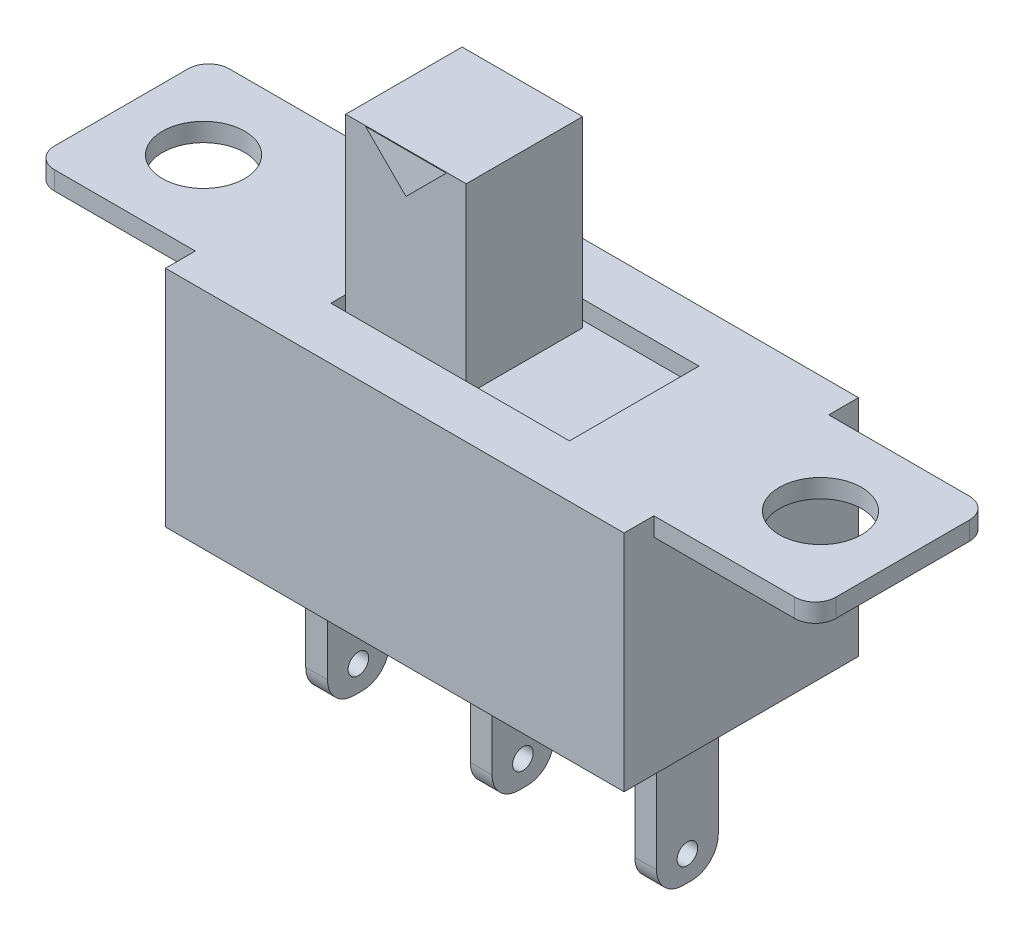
from build123d import *

# Parameters (mm, degrees)
ESQUISSE1_R             = 1
ESQUISSE1_W             = 5.8
ESQUISSE1_H             = 3.15
EXTRUSION1_DEPTH        = 0.45
ESQUISSE2_W             = 11.15
ESQUISSE2_H             = 5.7
EXTRUSION2_DEPTH        = 5
ESQUISSE3_W             = 0.53
ESQUISSE3_H             = 1.5
EXTRUSION3_DEPTH        = 4
CONG_1_R                = 0.65
ESQUISSE4_R             = 0.25
ENL_V_MAT_EXTRU_1_DEPTH = 18.585637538
ESQUISSE5_W             = 2.93
ESQUISSE5_H             = 2.83
EXTRUSION4_DEPTH        = 4.45
ENL_V_MAT_EXTRU_2_DEPTH = 21.697210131
CONG_2_R                = 0.5


with BuildPart() as part:
    # Esquisse1 → Extrusion1 (new body)
    with BuildSketch(Plane(origin=(0, 0, 0), x_dir=(1, 0, 0), z_dir=(0, 1, 0))):
        Polygon((14.218436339, 6.227312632), (14.218436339, 5.502312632), (18.143436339, 5.502312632), (18.143436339, 1.252312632), (14.218436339, 1.252312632), (14.218436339, 0.527312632), (3.068436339, 0.527312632), (3.068436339, 1.252312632), (-0.856563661, 1.252312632), (-0.856563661, 5.502312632), (3.068436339, 5.502312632), (3.068436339, 6.227312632), align=None)
        with Locations(Location((16.143436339, 3.377312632, 0), (0, 0, 270))):
            Circle(ESQUISSE1_R, mode=Mode.SUBTRACT)
        with Locations(Location((1.143436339, 3.377312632, 0), (0, 0, 90))):
            Circle(ESQUISSE1_R, mode=Mode.SUBTRACT)
        with Locations((8.715154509, 3.377312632)):
            Rectangle(ESQUISSE1_W, ESQUISSE1_H, mode=Mode.SUBTRACT)
    extrude(amount=EXTRUSION1_DEPTH)

    # Esquisse2 → Extrusion2 (add)
    with BuildSketch(Plane.XZ):
        with Locations((8.643436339, -3.377312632)):
            Rectangle(ESQUISSE2_W, ESQUISSE2_H)
    extrude(amount=EXTRUSION2_DEPTH)

    # Esquisse3 → Extrusion3 (add)
    with BuildSketch(Plane.XZ.offset(5)):
        with Locations((12.643436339, -3.377312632)):
            Rectangle(ESQUISSE3_W, ESQUISSE3_H)
        with Locations((8.643436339, -3.377312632)):
            Rectangle(ESQUISSE3_W, ESQUISSE3_H)
        with Locations((4.643436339, -3.377312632)):
            Rectangle(ESQUISSE3_W, ESQUISSE3_H)
    extrude(amount=EXTRUSION3_DEPTH)

    # Cong_1
    cong_1_edges = [part.edges().sort_by_distance(p)[0] for p in [
        (4.643436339, -9, -2.627312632),
        (4.643436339, -9, -4.127312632),
        (8.643436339, -9, -2.627312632),
        (8.643436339, -9, -4.127312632),
        (12.643436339, -9, -2.627312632),
        (12.643436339, -9, -4.127312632),
    ]]
    fillet(cong_1_edges, radius=CONG_1_R)

    # Esquisse4 → Enl_v. mat.-Extru.1 (cut, through all)
    with BuildSketch(Plane.ZY.offset(-4.378436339)):
        with Locations((-3.377312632, -8.382598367)):
            Circle(ESQUISSE4_R)
    extrude(amount=-ENL_V_MAT_EXTRU_1_DEPTH, mode=Mode.SUBTRACT)

    # Esquisse5 → Extrusion4 (add)
    with BuildSketch(Plane(origin=(0, 0, 0), x_dir=(-1, 0, 0), z_dir=(0, 1, 0))):
        with Locations((-7.480154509, -3.377312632)):
            Rectangle(ESQUISSE5_W, ESQUISSE5_H)
    extrude(amount=EXTRUSION4_DEPTH)

    # Esquisse6 → Enl_v. mat.-Extru.2 (cut, through all)
    with BuildSketch(Plane.XY.offset(-1.962312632)):
        Polygon((7.480154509, 3.45), (8.463104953, 4.432950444), (6.497204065, 4.432950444), align=None)
    extrude(amount=-ENL_V_MAT_EXTRU_2_DEPTH, mode=Mode.SUBTRACT)

    # Cong_2
    cong_2_edges = [part.edges().sort_by_distance(p)[0] for p in [
        (18.143436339, 0.225, -5.502312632),
        (18.143436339, 0.225, -1.252312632),
        (-0.856563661, 0.225, -1.252312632),
        (-0.856563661, 0.225, -5.502312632),
    ]]
    fillet(cong_2_edges, radius=CONG_2_R)


solid = part.part
